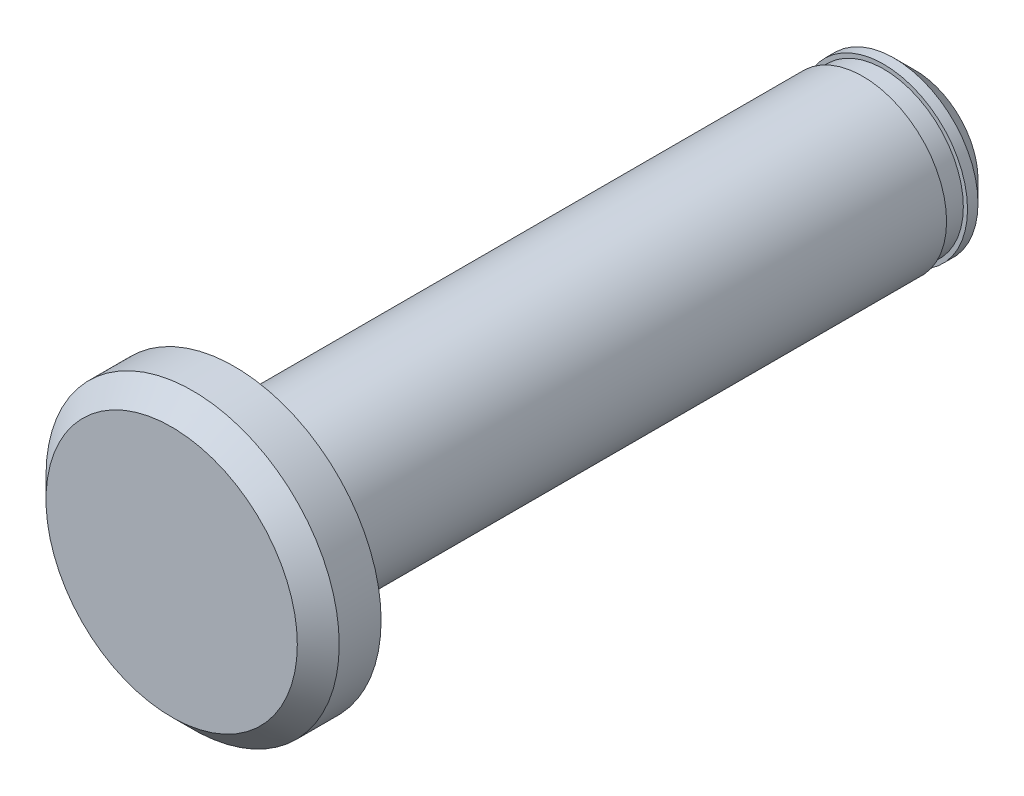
from build123d import *


with BuildPart() as part:
    # Esquisse2 → Base-R_volution (revolve)
    with BuildSketch(Plane(origin=(0, 0, 0), x_dir=(1, 0, 0), z_dir=(0, 1, 0)), mode=Mode.PRIVATE) as base_r_volution_sk:
        Polygon((-16.680780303, -30.626231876), (-16.680780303, -10.599160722), (-16.480780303, -10.599160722), (-16.480780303, -9.599160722), (-16.680780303, -9.599160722), (-16.680780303, -9.099160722), (-15.680780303, -8.099160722), (-12.680780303, -8.099160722), (-12.680780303, -43.599160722), (-18.680780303, -43.599160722), (-19.680780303, -42.599160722), (-19.680780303, -40.599160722), (-16.680780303, -40.599160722), align=None)
    revolve(base_r_volution_sk.sketch.rotate(Axis((-12.680780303, 0, 67.53791491), (0, 0, -1)), 180), axis=Axis((-12.680780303, 0, 67.53791491), (0, 0, -1)))


solid = part.part
